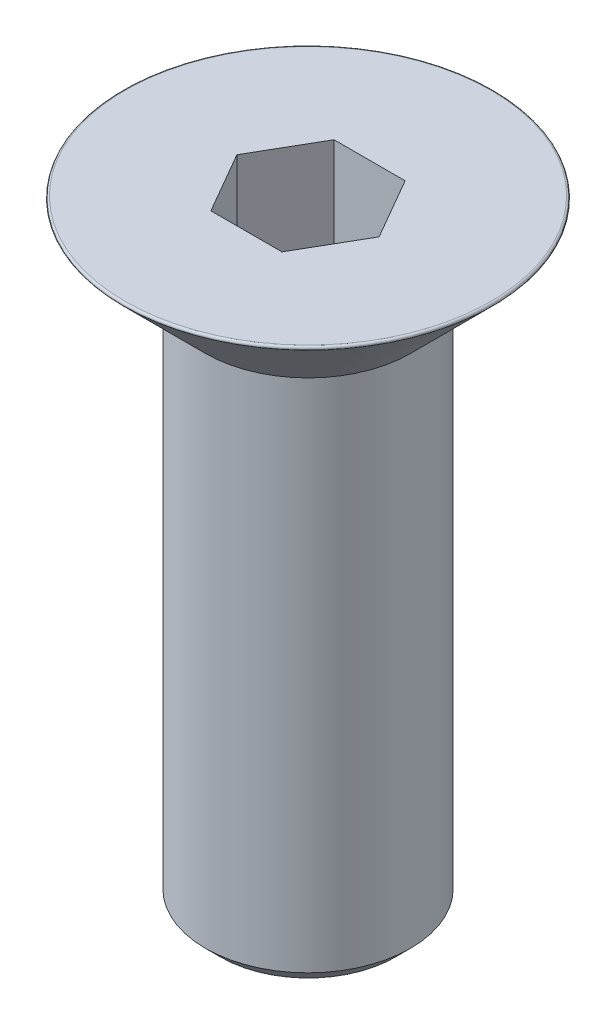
ISO-10303-21;
HEADER;
FILE_DESCRIPTION(('STEP AP214'),'2;1');
FILE_NAME('part.step','',(''),(''),'','','');
FILE_SCHEMA(('AUTOMOTIVE_DESIGN { 1 0 10303 214 1 1 1 1 }'));
ENDSEC;
DATA;
#1=APPLICATION_CONTEXT('core data for automotive mechanical design processes');
#2=APPLICATION_PROTOCOL_DEFINITION('international standard','automotive_design',2000,#1);
#3=PRODUCT_CONTEXT('',#1,'mechanical');
#4=PRODUCT('Part','Part','',(#3));
#5=PRODUCT_RELATED_PRODUCT_CATEGORY('part','',(#4));
#6=PRODUCT_DEFINITION_FORMATION('','',#4);
#7=PRODUCT_DEFINITION_CONTEXT('part definition',#1,'design');
#8=PRODUCT_DEFINITION('design','',#6,#7);
#9=PRODUCT_DEFINITION_SHAPE('','',#8);
#10=(LENGTH_UNIT() NAMED_UNIT(*) SI_UNIT(.MILLI.,.METRE.));
#11=(NAMED_UNIT(*) PLANE_ANGLE_UNIT() SI_UNIT($,.RADIAN.));
#12=(NAMED_UNIT(*) SI_UNIT($,.STERADIAN.) SOLID_ANGLE_UNIT());
#13=UNCERTAINTY_MEASURE_WITH_UNIT(LENGTH_MEASURE(1.E-05),#10,'distance_accuracy_value','');
#14=(GEOMETRIC_REPRESENTATION_CONTEXT(3) GLOBAL_UNCERTAINTY_ASSIGNED_CONTEXT((#13)) GLOBAL_UNIT_ASSIGNED_CONTEXT((#10,
#11,#12)) REPRESENTATION_CONTEXT('',''));
#15=CARTESIAN_POINT('',(0.,0.,0.));
#16=DIRECTION('',(0.,0.,1.));
#17=DIRECTION('',(1.,0.,0.));
#18=AXIS2_PLACEMENT_3D('',#15,#16,#17);
#19=CARTESIAN_POINT('',(0.,0.,0.));
#20=DIRECTION('',(0.,1.,0.));
#21=DIRECTION('',(0.,0.,1.));
#22=AXIS2_PLACEMENT_3D('',#19,#20,#21);
#23=PLANE('',#22);
#24=CARTESIAN_POINT('',(0.,0.,0.));
#25=DIRECTION('',(0.,1.,0.));
#26=DIRECTION('',(0.,0.,1.));
#27=AXIS2_PLACEMENT_3D('',#24,#25,#26);
#28=CIRCLE('',#27,8.90857864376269);
#29=CARTESIAN_POINT('',(0.,0.,8.90857864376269));
#30=VERTEX_POINT('',#29);
#31=EDGE_CURVE('E35',#30,#30,#28,.T.);
#32=ORIENTED_EDGE('',*,*,#31,.T.);
#33=EDGE_LOOP('',(#32));
#34=FACE_BOUND('',#33,.T.);
#35=DIRECTION('',(1.,0.,0.));
#36=VECTOR('',#35,1.);
#37=CARTESIAN_POINT('',(-1.73205080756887,-5.6843418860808E-11,3.));
#38=LINE('',#37,#36);
#39=CARTESIAN_POINT('',(-1.73205080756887,-5.6843418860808E-11,3.));
#40=VERTEX_POINT('',#39);
#41=CARTESIAN_POINT('',(1.73205080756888,0.,2.99999999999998));
#42=VERTEX_POINT('',#41);
#43=EDGE_CURVE('E42',#40,#42,#38,.T.);
#44=ORIENTED_EDGE('',*,*,#43,.F.);
#45=DIRECTION('',(-0.500000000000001,0.,-0.866025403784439));
#46=VECTOR('',#45,1.);
#47=CARTESIAN_POINT('',(-1.73205080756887,-5.6843418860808E-11,3.));
#48=LINE('',#47,#46);
#49=CARTESIAN_POINT('',(-3.46410161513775,-5.6843418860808E-11,0.));
#50=VERTEX_POINT('',#49);
#51=EDGE_CURVE('E110',#40,#50,#48,.T.);
#52=ORIENTED_EDGE('',*,*,#51,.T.);
#53=DIRECTION('',(-0.499999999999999,0.,0.866025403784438));
#54=VECTOR('',#53,1.);
#55=CARTESIAN_POINT('',(-1.73205080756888,-5.6843418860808E-11,-3.));
#56=LINE('',#55,#54);
#57=CARTESIAN_POINT('',(-1.73205080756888,-5.6843418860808E-11,-3.));
#58=VERTEX_POINT('',#57);
#59=EDGE_CURVE('E104',#58,#50,#56,.T.);
#60=ORIENTED_EDGE('',*,*,#59,.F.);
#61=DIRECTION('',(1.,0.,0.));
#62=VECTOR('',#61,1.);
#63=CARTESIAN_POINT('',(-1.73205080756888,-5.6843418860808E-11,-3.));
#64=LINE('',#63,#62);
#65=CARTESIAN_POINT('',(1.73205080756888,-5.6843418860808E-11,-3.00000000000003));
#66=VERTEX_POINT('',#65);
#67=EDGE_CURVE('E102',#58,#66,#64,.T.);
#68=ORIENTED_EDGE('',*,*,#67,.T.);
#69=DIRECTION('',(0.500000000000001,0.,0.866025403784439));
#70=VECTOR('',#69,1.);
#71=CARTESIAN_POINT('',(1.73205080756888,-5.6843418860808E-11,-3.00000000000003));
#72=LINE('',#71,#70);
#73=CARTESIAN_POINT('',(3.46410161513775,-5.6843418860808E-11,0.));
#74=VERTEX_POINT('',#73);
#75=EDGE_CURVE('E85',#66,#74,#72,.T.);
#76=ORIENTED_EDGE('',*,*,#75,.T.);
#77=DIRECTION('',(0.499999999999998,0.,-0.866025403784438));
#78=VECTOR('',#77,1.);
#79=CARTESIAN_POINT('',(1.73205080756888,-5.6843418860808E-11,2.99999999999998));
#80=LINE('',#79,#78);
#81=EDGE_CURVE('E96',#42,#74,#80,.T.);
#82=ORIENTED_EDGE('',*,*,#81,.F.);
#83=EDGE_LOOP('',(#44,#52,#60,#68,#76,#82));
#84=FACE_BOUND('',#83,.T.);
#85=ADVANCED_FACE('F28',(#34,#84),#23,.T.);
#86=CARTESIAN_POINT('',(0.,0.,0.));
#87=DIRECTION('',(0.,1.,0.));
#88=DIRECTION('',(0.,0.,1.));
#89=AXIS2_PLACEMENT_3D('',#86,#87,#88);
#90=CONICAL_SURFACE('',#89,9.15,0.78539816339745);
#91=CARTESIAN_POINT('',(0.,-0.170710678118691,0.));
#92=DIRECTION('',(0.,-1.,0.));
#93=DIRECTION('',(0.,0.,-1.));
#94=AXIS2_PLACEMENT_3D('',#91,#92,#93);
#95=CIRCLE('',#94,8.97928932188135);
#96=CARTESIAN_POINT('',(0.,-0.170710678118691,-8.97928932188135));
#97=VERTEX_POINT('',#96);
#98=EDGE_CURVE('E11',#97,#97,#95,.T.);
#99=ORIENTED_EDGE('',*,*,#98,.T.);
#100=EDGE_LOOP('',(#99));
#101=FACE_BOUND('',#100,.T.);
#102=CARTESIAN_POINT('',(0.,-4.14999999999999,0.));
#103=DIRECTION('',(0.,1.,0.));
#104=DIRECTION('',(0.,0.,1.));
#105=AXIS2_PLACEMENT_3D('',#102,#103,#104);
#106=CIRCLE('',#105,5.);
#107=CARTESIAN_POINT('',(0.,-4.14999999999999,5.));
#108=VERTEX_POINT('',#107);
#109=EDGE_CURVE('E127',#108,#108,#106,.T.);
#110=ORIENTED_EDGE('',*,*,#109,.T.);
#111=EDGE_LOOP('',(#110));
#112=FACE_BOUND('',#111,.T.);
#113=ADVANCED_FACE('F158',(#101,#112),#90,.T.);
#114=CARTESIAN_POINT('',(0.,18.0202513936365,0.));
#115=DIRECTION('',(0.,1.,0.));
#116=DIRECTION('',(0.,0.,1.));
#117=AXIS2_PLACEMENT_3D('',#114,#115,#116);
#118=CYLINDRICAL_SURFACE('',#117,5.);
#119=CARTESIAN_POINT('',(0.,-29.25,0.));
#120=DIRECTION('',(0.,-1.,0.));
#121=DIRECTION('',(0.,0.,-1.));
#122=AXIS2_PLACEMENT_3D('',#119,#120,#121);
#123=CIRCLE('',#122,5.);
#124=CARTESIAN_POINT('',(0.,-29.25,4.99999999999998));
#125=VERTEX_POINT('',#124);
#126=EDGE_CURVE('E136',#125,#125,#123,.F.);
#127=ORIENTED_EDGE('',*,*,#126,.T.);
#128=EDGE_LOOP('',(#127));
#129=FACE_BOUND('',#128,.T.);
#130=ORIENTED_EDGE('',*,*,#109,.F.);
#131=EDGE_LOOP('',(#130));
#132=FACE_BOUND('',#131,.T.);
#133=ADVANCED_FACE('F162',(#129,#132),#118,.T.);
#134=CARTESIAN_POINT('',(5.,-29.9999999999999,0.));
#135=DIRECTION('',(0.,-1.,0.));
#136=DIRECTION('',(0.,0.,-1.));
#137=AXIS2_PLACEMENT_3D('',#134,#135,#136);
#138=PLANE('',#137);
#139=CARTESIAN_POINT('',(0.,-30.,0.));
#140=DIRECTION('',(0.,-1.,0.));
#141=DIRECTION('',(0.,0.,-1.));
#142=AXIS2_PLACEMENT_3D('',#139,#140,#141);
#143=CIRCLE('',#142,4.25);
#144=CARTESIAN_POINT('',(0.,-30.,4.24999999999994));
#145=VERTEX_POINT('',#144);
#146=EDGE_CURVE('E139',#145,#145,#143,.T.);
#147=ORIENTED_EDGE('',*,*,#146,.T.);
#148=EDGE_LOOP('',(#147));
#149=FACE_BOUND('',#148,.T.);
#150=ADVANCED_FACE('F167',(#149),#138,.T.);
#151=CARTESIAN_POINT('',(-1.73205080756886,-5.00000000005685,3.));
#152=DIRECTION('',(0.,0.,1.));
#153=DIRECTION('',(1.,0.,0.));
#154=AXIS2_PLACEMENT_3D('',#151,#152,#153);
#155=PLANE('',#154);
#156=ORIENTED_EDGE('',*,*,#43,.T.);
#157=DIRECTION('',(0.,1.,0.));
#158=VECTOR('',#157,1.);
#159=CARTESIAN_POINT('',(1.73205080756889,-5.00000000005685,3.));
#160=LINE('',#159,#158);
#161=CARTESIAN_POINT('',(1.73205080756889,-5.00000000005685,3.));
#162=VERTEX_POINT('',#161);
#163=EDGE_CURVE('E93',#162,#42,#160,.T.);
#164=ORIENTED_EDGE('',*,*,#163,.F.);
#165=DIRECTION('',(1.,0.,0.));
#166=VECTOR('',#165,1.);
#167=CARTESIAN_POINT('',(-1.73205080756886,-5.00000000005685,3.));
#168=LINE('',#167,#166);
#169=CARTESIAN_POINT('',(-1.73205080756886,-5.00000000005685,3.));
#170=VERTEX_POINT('',#169);
#171=EDGE_CURVE('E113',#170,#162,#168,.T.);
#172=ORIENTED_EDGE('',*,*,#171,.F.);
#173=DIRECTION('',(0.,1.,0.));
#174=VECTOR('',#173,1.);
#175=CARTESIAN_POINT('',(-1.73205080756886,-5.00000000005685,3.));
#176=LINE('',#175,#174);
#177=EDGE_CURVE('E49',#170,#40,#176,.T.);
#178=ORIENTED_EDGE('',*,*,#177,.T.);
#179=EDGE_LOOP('',(#156,#164,#172,#178));
#180=FACE_BOUND('',#179,.T.);
#181=ADVANCED_FACE('F174',(#180),#155,.F.);
#182=CARTESIAN_POINT('',(-1.73205080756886,-5.00000000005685,3.));
#183=DIRECTION('',(0.866025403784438,0.,-0.499999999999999));
#184=DIRECTION('',(-0.500000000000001,0.,-0.866025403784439));
#185=AXIS2_PLACEMENT_3D('',#182,#183,#184);
#186=PLANE('',#185);
#187=ORIENTED_EDGE('',*,*,#51,.F.);
#188=ORIENTED_EDGE('',*,*,#177,.F.);
#189=DIRECTION('',(-0.500000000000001,0.,-0.866025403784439));
#190=VECTOR('',#189,1.);
#191=CARTESIAN_POINT('',(-1.73205080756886,-5.00000000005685,3.));
#192=LINE('',#191,#190);
#193=CARTESIAN_POINT('',(-3.46410161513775,-5.00000000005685,0.));
#194=VERTEX_POINT('',#193);
#195=EDGE_CURVE('E124',#170,#194,#192,.T.);
#196=ORIENTED_EDGE('',*,*,#195,.T.);
#197=DIRECTION('',(0.,1.,0.));
#198=VECTOR('',#197,1.);
#199=CARTESIAN_POINT('',(-3.46410161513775,-5.00000000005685,0.));
#200=LINE('',#199,#198);
#201=EDGE_CURVE('E128',#194,#50,#200,.T.);
#202=ORIENTED_EDGE('',*,*,#201,.T.);
#203=EDGE_LOOP('',(#187,#188,#196,#202));
#204=FACE_BOUND('',#203,.T.);
#205=ADVANCED_FACE('F178',(#204),#186,.T.);
#206=CARTESIAN_POINT('',(-1.73205080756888,-5.00000000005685,-3.));
#207=DIRECTION('',(-0.866025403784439,0.,-0.500000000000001));
#208=DIRECTION('',(-0.499999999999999,0.,0.866025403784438));
#209=AXIS2_PLACEMENT_3D('',#206,#207,#208);
#210=PLANE('',#209);
#211=ORIENTED_EDGE('',*,*,#59,.T.);
#212=ORIENTED_EDGE('',*,*,#201,.F.);
#213=DIRECTION('',(-0.499999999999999,0.,0.866025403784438));
#214=VECTOR('',#213,1.);
#215=CARTESIAN_POINT('',(-1.73205080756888,-5.00000000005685,-3.));
#216=LINE('',#215,#214);
#217=CARTESIAN_POINT('',(-1.73205080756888,-5.00000000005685,-3.));
#218=VERTEX_POINT('',#217);
#219=EDGE_CURVE('E121',#218,#194,#216,.T.);
#220=ORIENTED_EDGE('',*,*,#219,.F.);
#221=DIRECTION('',(0.,1.,0.));
#222=VECTOR('',#221,1.);
#223=CARTESIAN_POINT('',(-1.73205080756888,-5.00000000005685,-3.));
#224=LINE('',#223,#222);
#225=EDGE_CURVE('E130',#218,#58,#224,.T.);
#226=ORIENTED_EDGE('',*,*,#225,.T.);
#227=EDGE_LOOP('',(#211,#212,#220,#226));
#228=FACE_BOUND('',#227,.T.);
#229=ADVANCED_FACE('F186',(#228),#210,.F.);
#230=CARTESIAN_POINT('',(-1.73205080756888,-5.00000000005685,-3.));
#231=DIRECTION('',(0.,0.,1.));
#232=DIRECTION('',(1.,0.,0.));
#233=AXIS2_PLACEMENT_3D('',#230,#231,#232);
#234=PLANE('',#233);
#235=ORIENTED_EDGE('',*,*,#67,.F.);
#236=ORIENTED_EDGE('',*,*,#225,.F.);
#237=DIRECTION('',(1.,0.,0.));
#238=VECTOR('',#237,1.);
#239=CARTESIAN_POINT('',(-1.73205080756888,-5.00000000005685,-3.));
#240=LINE('',#239,#238);
#241=CARTESIAN_POINT('',(1.73205080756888,-5.00000000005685,-3.));
#242=VERTEX_POINT('',#241);
#243=EDGE_CURVE('E119',#218,#242,#240,.T.);
#244=ORIENTED_EDGE('',*,*,#243,.T.);
#245=DIRECTION('',(0.,1.,0.));
#246=VECTOR('',#245,1.);
#247=CARTESIAN_POINT('',(1.73205080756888,-5.00000000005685,-3.));
#248=LINE('',#247,#246);
#249=EDGE_CURVE('E92',#242,#66,#248,.T.);
#250=ORIENTED_EDGE('',*,*,#249,.T.);
#251=EDGE_LOOP('',(#235,#236,#244,#250));
#252=FACE_BOUND('',#251,.T.);
#253=ADVANCED_FACE('F183',(#252),#234,.T.);
#254=CARTESIAN_POINT('',(1.73205080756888,-5.00000000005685,-3.));
#255=DIRECTION('',(-0.866025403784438,0.,0.499999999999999));
#256=DIRECTION('',(0.500000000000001,0.,0.866025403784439));
#257=AXIS2_PLACEMENT_3D('',#254,#255,#256);
#258=PLANE('',#257);
#259=ORIENTED_EDGE('',*,*,#75,.F.);
#260=ORIENTED_EDGE('',*,*,#249,.F.);
#261=DIRECTION('',(0.500000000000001,0.,0.866025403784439));
#262=VECTOR('',#261,1.);
#263=CARTESIAN_POINT('',(1.73205080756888,-5.00000000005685,-3.));
#264=LINE('',#263,#262);
#265=CARTESIAN_POINT('',(3.46410161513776,-5.00000000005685,0.));
#266=VERTEX_POINT('',#265);
#267=EDGE_CURVE('E88',#242,#266,#264,.T.);
#268=ORIENTED_EDGE('',*,*,#267,.T.);
#269=DIRECTION('',(0.,1.,0.));
#270=VECTOR('',#269,1.);
#271=CARTESIAN_POINT('',(3.46410161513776,-5.00000000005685,0.));
#272=LINE('',#271,#270);
#273=EDGE_CURVE('E80',#266,#74,#272,.T.);
#274=ORIENTED_EDGE('',*,*,#273,.T.);
#275=EDGE_LOOP('',(#259,#260,#268,#274));
#276=FACE_BOUND('',#275,.T.);
#277=ADVANCED_FACE('F82',(#276),#258,.T.);
#278=CARTESIAN_POINT('',(1.73205080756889,-5.00000000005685,3.));
#279=DIRECTION('',(0.866025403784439,0.,0.500000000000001));
#280=DIRECTION('',(0.499999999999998,0.,-0.866025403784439));
#281=AXIS2_PLACEMENT_3D('',#278,#279,#280);
#282=PLANE('',#281);
#283=ORIENTED_EDGE('',*,*,#81,.T.);
#284=ORIENTED_EDGE('',*,*,#273,.F.);
#285=DIRECTION('',(0.499999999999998,0.,-0.866025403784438));
#286=VECTOR('',#285,1.);
#287=CARTESIAN_POINT('',(1.73205080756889,-5.00000000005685,3.));
#288=LINE('',#287,#286);
#289=EDGE_CURVE('E116',#162,#266,#288,.T.);
#290=ORIENTED_EDGE('',*,*,#289,.F.);
#291=ORIENTED_EDGE('',*,*,#163,.T.);
#292=EDGE_LOOP('',(#283,#284,#290,#291));
#293=FACE_BOUND('',#292,.T.);
#294=ADVANCED_FACE('F97',(#293),#282,.F.);
#295=CARTESIAN_POINT('',(1.73205080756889,-5.00000000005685,3.));
#296=DIRECTION('',(0.,1.,0.));
#297=DIRECTION('',(0.,0.,1.));
#298=AXIS2_PLACEMENT_3D('',#295,#296,#297);
#299=PLANE('',#298);
#300=ORIENTED_EDGE('',*,*,#171,.T.);
#301=ORIENTED_EDGE('',*,*,#289,.T.);
#302=ORIENTED_EDGE('',*,*,#267,.F.);
#303=ORIENTED_EDGE('',*,*,#243,.F.);
#304=ORIENTED_EDGE('',*,*,#219,.T.);
#305=ORIENTED_EDGE('',*,*,#195,.F.);
#306=EDGE_LOOP('',(#300,#301,#302,#303,#304,#305));
#307=FACE_BOUND('',#306,.T.);
#308=ADVANCED_FACE('F153',(#307),#299,.T.);
#309=CARTESIAN_POINT('',(0.,-29.25,0.));
#310=DIRECTION('',(0.,1.,0.));
#311=DIRECTION('',(0.,0.,1.));
#312=AXIS2_PLACEMENT_3D('',#309,#310,#311);
#313=CONICAL_SURFACE('',#312,5.,0.785398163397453);
#314=CARTESIAN_POINT('',(0.,-30.,4.24999999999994));
#315=CARTESIAN_POINT('',(0.,-29.9921875,4.25781249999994));
#316=CARTESIAN_POINT('',(0.,-29.984375,4.26562499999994));
#317=CARTESIAN_POINT('',(0.,-29.96875,4.28124999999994));
#318=CARTESIAN_POINT('',(0.,-29.9609375,4.28906249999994));
#319=CARTESIAN_POINT('',(0.,-29.9453125,4.30468749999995));
#320=CARTESIAN_POINT('',(0.,-29.9375,4.31249999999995));
#321=CARTESIAN_POINT('',(0.,-29.921875,4.32812499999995));
#322=CARTESIAN_POINT('',(0.,-29.9140625,4.33593749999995));
#323=CARTESIAN_POINT('',(0.,-29.8984375,4.35156249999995));
#324=CARTESIAN_POINT('',(0.,-29.890625,4.35937499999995));
#325=CARTESIAN_POINT('',(0.,-29.875,4.37499999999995));
#326=CARTESIAN_POINT('',(0.,-29.8671875,4.38281249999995));
#327=CARTESIAN_POINT('',(0.,-29.8515625,4.39843749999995));
#328=CARTESIAN_POINT('',(0.,-29.84375,4.40624999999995));
#329=CARTESIAN_POINT('',(0.,-29.828125,4.42187499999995));
#330=CARTESIAN_POINT('',(0.,-29.8203125,4.42968749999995));
#331=CARTESIAN_POINT('',(0.,-29.8046875,4.44531249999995));
#332=CARTESIAN_POINT('',(0.,-29.796875,4.45312499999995));
#333=CARTESIAN_POINT('',(0.,-29.78125,4.46874999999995));
#334=CARTESIAN_POINT('',(0.,-29.7734375,4.47656249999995));
#335=CARTESIAN_POINT('',(0.,-29.7578125,4.49218749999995));
#336=CARTESIAN_POINT('',(0.,-29.75,4.49999999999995));
#337=CARTESIAN_POINT('',(0.,-29.734375,4.51562499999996));
#338=CARTESIAN_POINT('',(0.,-29.7265625,4.52343749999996));
#339=CARTESIAN_POINT('',(0.,-29.7109375,4.53906249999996));
#340=CARTESIAN_POINT('',(0.,-29.703125,4.54687499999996));
#341=CARTESIAN_POINT('',(0.,-29.6875,4.56249999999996));
#342=CARTESIAN_POINT('',(0.,-29.6796875,4.57031249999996));
#343=CARTESIAN_POINT('',(0.,-29.6640625,4.58593749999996));
#344=CARTESIAN_POINT('',(0.,-29.65625,4.59374999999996));
#345=CARTESIAN_POINT('',(0.,-29.640625,4.60937499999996));
#346=CARTESIAN_POINT('',(0.,-29.6328125,4.61718749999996));
#347=CARTESIAN_POINT('',(0.,-29.6171875,4.63281249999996));
#348=CARTESIAN_POINT('',(0.,-29.609375,4.64062499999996));
#349=CARTESIAN_POINT('',(0.,-29.59375,4.65624999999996));
#350=CARTESIAN_POINT('',(0.,-29.5859375,4.66406249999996));
#351=CARTESIAN_POINT('',(0.,-29.5703125,4.67968749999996));
#352=CARTESIAN_POINT('',(0.,-29.5625,4.68749999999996));
#353=CARTESIAN_POINT('',(0.,-29.546875,4.70312499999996));
#354=CARTESIAN_POINT('',(0.,-29.5390625,4.71093749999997));
#355=CARTESIAN_POINT('',(0.,-29.5234375,4.72656249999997));
#356=CARTESIAN_POINT('',(0.,-29.515625,4.73437499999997));
#357=CARTESIAN_POINT('',(0.,-29.5,4.74999999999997));
#358=CARTESIAN_POINT('',(0.,-29.4921875,4.75781249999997));
#359=CARTESIAN_POINT('',(0.,-29.4765625,4.77343749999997));
#360=CARTESIAN_POINT('',(0.,-29.46875,4.78124999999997));
#361=CARTESIAN_POINT('',(0.,-29.453125,4.79687499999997));
#362=CARTESIAN_POINT('',(0.,-29.4453125,4.80468749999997));
#363=CARTESIAN_POINT('',(0.,-29.4296875,4.82031249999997));
#364=CARTESIAN_POINT('',(0.,-29.421875,4.82812499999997));
#365=CARTESIAN_POINT('',(0.,-29.40625,4.84374999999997));
#366=CARTESIAN_POINT('',(0.,-29.3984375,4.85156249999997));
#367=CARTESIAN_POINT('',(0.,-29.3828125,4.86718749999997));
#368=CARTESIAN_POINT('',(0.,-29.375,4.87499999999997));
#369=CARTESIAN_POINT('',(0.,-29.359375,4.89062499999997));
#370=CARTESIAN_POINT('',(0.,-29.3515625,4.89843749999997));
#371=CARTESIAN_POINT('',(0.,-29.3359375,4.91406249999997));
#372=CARTESIAN_POINT('',(0.,-29.328125,4.92187499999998));
#373=CARTESIAN_POINT('',(0.,-29.3125,4.93749999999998));
#374=CARTESIAN_POINT('',(0.,-29.3046875,4.94531249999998));
#375=CARTESIAN_POINT('',(0.,-29.2890625,4.96093749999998));
#376=CARTESIAN_POINT('',(0.,-29.28125,4.96874999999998));
#377=CARTESIAN_POINT('',(0.,-29.265625,4.98437499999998));
#378=CARTESIAN_POINT('',(0.,-29.2578125,4.99218749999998));
#379=CARTESIAN_POINT('',(0.,-29.25,4.99999999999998));
#380=B_SPLINE_CURVE_WITH_KNOTS('',3,(#314,#315,#316,#317,#318,#319,#320,#321,#322,#323,#324,
#325,#326,#327,#328,#329,#330,#331,#332,#333,#334,#335,#336,#337,#338,#339,#340,#341,#342,#343,
#344,#345,#346,#347,#348,#349,#350,#351,#352,#353,#354,#355,#356,#357,#358,#359,#360,#361,#362,
#363,#364,#365,#366,#367,#368,#369,#370,#371,#372,#373,#374,#375,#376,#377,#378,#379),
.UNSPECIFIED.,.F.,.F.,(4,2,2,2,2,2,2,2,2,2,2,2,2,2,2,2,2,2,2,2,2,2,2,2,2,2,2,2,2,2,2,2,4),(0.,
0.0331456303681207,0.0662912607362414,0.0994368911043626,0.132582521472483,0.165728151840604,
0.198873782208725,0.232019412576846,0.265165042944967,0.298310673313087,0.331456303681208,
0.364601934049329,0.39774756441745,0.430893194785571,0.464038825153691,0.497184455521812,
0.530330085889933,0.563475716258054,0.596621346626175,0.629766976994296,0.662912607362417,
0.696058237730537,0.729203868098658,0.762349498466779,0.7954951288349,0.828640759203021,
0.861786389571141,0.894932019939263,0.928077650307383,0.961223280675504,0.994368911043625,
1.02751454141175,1.06066017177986),.UNSPECIFIED.);
#381=EDGE_CURVE('BSEAM147',#145,#125,#380,.T.);
#382=ORIENTED_EDGE('',*,*,#146,.F.);
#383=ORIENTED_EDGE('',*,*,#126,.F.);
#384=ORIENTED_EDGE('',*,*,#381,.T.);
#385=ORIENTED_EDGE('',*,*,#381,.F.);
#386=EDGE_LOOP('',(#382,#384,#383,#385));
#387=FACE_BOUND('',#386,.T.);
#388=ADVANCED_FACE('F147',(#387),#313,.T.);
#389=CARTESIAN_POINT('',(0.,-0.099999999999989,0.));
#390=DIRECTION('',(0.,1.,0.));
#391=DIRECTION('',(0.,0.,1.));
#392=AXIS2_PLACEMENT_3D('',#389,#390,#391);
#393=TOROIDAL_SURFACE('',#392,8.90857864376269,0.1);
#394=ORIENTED_EDGE('',*,*,#98,.F.);
#395=EDGE_LOOP('',(#394));
#396=FACE_BOUND('',#395,.T.);
#397=ORIENTED_EDGE('',*,*,#31,.F.);
#398=EDGE_LOOP('',(#397));
#399=FACE_BOUND('',#398,.T.);
#400=ADVANCED_FACE('F145',(#396,#399),#393,.T.);
#401=CLOSED_SHELL('',(#85,#113,#133,#150,#181,#205,#229,#253,#277,#294,#308,#388,#400));
#402=MANIFOLD_SOLID_BREP('B2',#401);
#403=ADVANCED_BREP_SHAPE_REPRESENTATION('',(#18,#402),#14);
#404=SHAPE_DEFINITION_REPRESENTATION(#9,#403);
ENDSEC;
END-ISO-10303-21;
